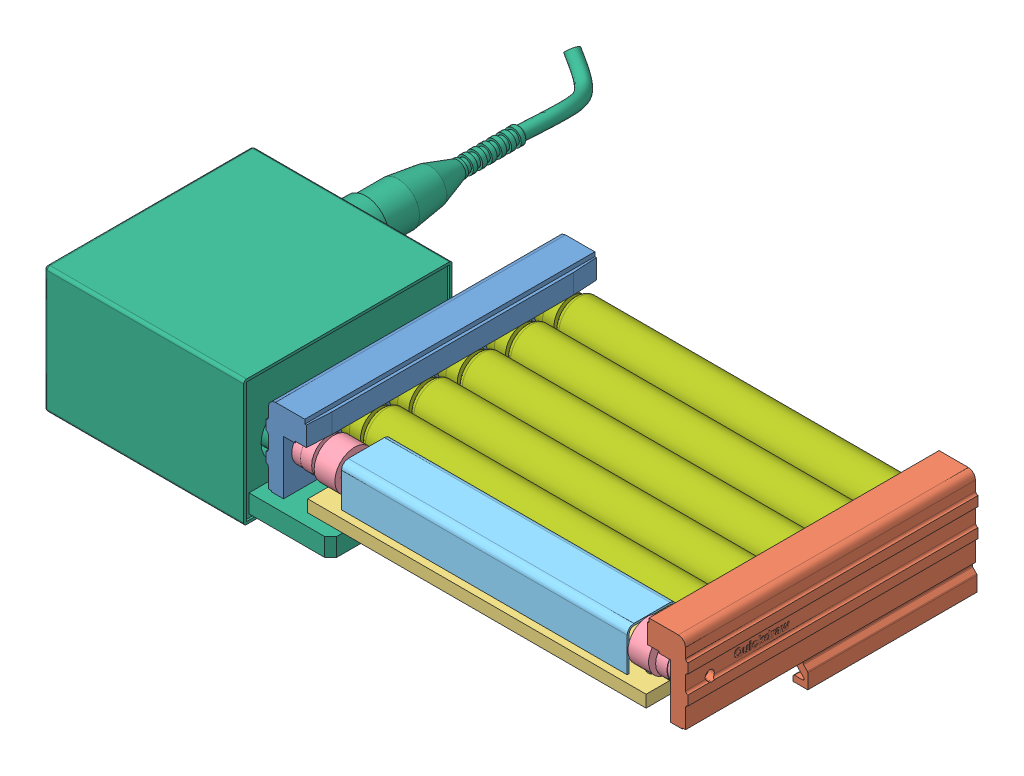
SolidWorks assembly Quickdraw-LR6TS-7-DDL-ESD.SLDASM, configuration Default (file format 12000). Lengths in mm.
Overall size (328.19 66.24 271.88).
12 component instances, 7 part files, 21 mates.
Components (placement in the parent):
- Quickdraw-LR6TS-7-DDL-ESD_LHRail-1: Quickdraw-LR6TS-7-DDL-ESD_LHRail.SLDPRT [TS] at (-21.463 -54.5084 0) size (22.1 54.51 152.4)
- Quickdraw-LR6TS-7-DDL-ESD_RHRail-1: Quickdraw-LR6TS-7-DDL-ESD_RHRail.SLDPRT [TS] at (199.263 -54.5084 0) x (-1 0 0) z (0 0 -1) size (22.1 54.51 152.4)
- Quickdraw-LR6TS-7-DDL-ESD_END PLATE-1: Quickdraw-LR6TS-7-DDL-ESD_END PLATE.SLDPRT [Default] at (0 -35.4584 0) size (177.8 6.35 101.6)
- Quickdraw-LR6TS-7-DDL-ESD_MR ROLLER ASSY LT-1: Quickdraw-LR6TS-7-DDL-ESD_MR ROLLER ASSY LT.SLDPRT [SD] at (-17.7038 -22.7076 -12.7) x (0 0 1) z (-1 0 0) size (20.75 20.75 31.27)
- Quickdraw-LR6TS-7-DDL-ESD_MR ROLLER ASSY LT-2: Quickdraw-LR6TS-7-DDL-ESD_MR ROLLER ASSY LT.SLDPRT [SD] at (195.5038 -22.7076 -12.7) x (0 0 -1) z (1 0 0) size (20.75 20.75 31.27)
- Quickdraw-LR6TS-7-DDL-ESD_collar_cover-1: Quickdraw-LR6TS-7-DDL-ESD_collar_cover.SLDPRT [Default] at (88.9 -34.4348 -54.6608) x (0 0 1) z (-1 0 0) size (50.8 21.59 150.11)
- Quickdraw-LR6TS-7-DDL-ESD_Motor PKG  DDL-1: Quickdraw-LR6TS-7-DDL-ESD_Motor PKG  DDL.SLDPRT [Default] at (-128.2954 -26.8349 -65.7893) size (146.69 66.24 271.88)
- Quickdraw-LR6TS-7-DDL-ESD_LongRoller-1: Quickdraw-LR6TS-7-DDL-ESD_LongRoller.SLDPRT [ESD] at (-17.7038 -22.7076 -139.7) x (0 -0.769947 -0.638108) z (1 0 0) size (21.97 21.97 213.21)
- Quickdraw-LR6TS-7-DDL-ESD_LongRoller-61: Quickdraw-LR6TS-7-DDL-ESD_LongRoller.SLDPRT [ESD] at (-17.7038 -22.7076 -114.3) x (0 -0.769947 -0.638108) z (1 0 0) size (21.97 21.97 213.21)
- Quickdraw-LR6TS-7-DDL-ESD_LongRoller-62: Quickdraw-LR6TS-7-DDL-ESD_LongRoller.SLDPRT [ESD] at (-17.7038 -22.7076 -88.9) x (0 -0.769947 -0.638108) z (1 0 0) size (21.97 21.97 213.21)
- Quickdraw-LR6TS-7-DDL-ESD_LongRoller-63: Quickdraw-LR6TS-7-DDL-ESD_LongRoller.SLDPRT [ESD] at (-17.7038 -22.7076 -63.5) x (0 -0.769947 -0.638108) z (1 0 0) size (21.97 21.97 213.21)
- Quickdraw-LR6TS-7-DDL-ESD_LongRoller-64: Quickdraw-LR6TS-7-DDL-ESD_LongRoller.SLDPRT [ESD] at (-17.7038 -22.7076 -38.1) x (0 -0.769947 -0.638108) z (1 0 0) size (21.97 21.97 213.21)
Mates (geometry in assembly coordinates):
- Coincident2: coincident: plane of LHRail-1 through (-16.9164 -3.81 0) normal (0 0 1)
- Coincident3: coincident: plane of LHRail-1 through (0 -54.5084 0) normal (1 0 0)
- Coincident4: coincident aligned: plane of LHRail-1 through (-1.5469 0 -152.4) normal (0 1 0)
- Coincident5: coincident aligned: plane of LHRail-1 through (-1.5469 0 -152.4) normal (0 1 0); plane of RHRail-1 through (179.3469 0 -152.4) normal (0 1 0)
- Coincident6: coincident aligned: plane of LHRail-1 through (-16.9164 -3.81 0) normal (0 0 1); plane of RHRail-1 through (194.7164 -3.81 0) normal (0 0 1)
- Coincident7: coincident: plane of RHRail-1 through (177.8 -54.5084 0) normal (-1 0 0)
- Coincident12: coincident anti-aligned: plane of LHRail-1 through (0 -54.5084 -152.4) normal (1 0 0); plane of Quickdraw-LR6TS-7-DDL-ESD_END PLATE-1 through (0 -41.8084 0) normal (-1 0 0)
- Coincident13: coincident aligned: plane of LHRail-1 through (-16.9164 -3.81 0) normal (0 0 1); plane of Quickdraw-LR6TS-7-DDL-ESD_END PLATE-1 through (279.5982 -35.4584 0) normal (0 0 1)
- Concentric1: concentric anti-aligned: cylinder of LHRail-1 through (-21.9965 -22.7076 -12.7) axis (1 0 0) radius 2.413; cylinder of Quickdraw-LR6TS-7-DDL-ESD_MR ROLLER ASSY LT-1 through (-12.7 -22.7076 -12.7) axis (-1 0 0) radius 2.413
- Coincident18: coincident anti-aligned: plane of LHRail-1 through (-12.7 -35.4584 -152.4) normal (1 0 0); plane of Quickdraw-LR6TS-7-DDL-ESD_MR ROLLER ASSY LT-1 through (-12.7 -22.7076 -12.7) normal (-1 0 0)
- Coincident19: coincident anti-aligned: plane of RHRail-1 through (190.5 -35.4584 -152.4) normal (-1 0 0); plane of Quickdraw-LR6TS-7-DDL-ESD_MR ROLLER ASSY LT-2 through (190.5 -22.7076 -12.7) normal (1 0 0)
- Concentric2: concentric anti-aligned: cylinder of RHRail-1 through (199.7965 -22.7076 -12.7) axis (-1 0 0) radius 2.413; cylinder of Quickdraw-LR6TS-7-DDL-ESD_MR ROLLER ASSY LT-2 through (190.5 -22.7076 -12.7) axis (1 0 0) radius 2.413
- Coincident23: coincident anti-aligned: plane of Quickdraw-LR6TS-7-DDL-ESD_END PLATE-1 through (279.5982 -35.4584 0) normal (0 1 0); plane of Quickdraw-LR6TS-7-DDL-ESD_collar_cover-1 through (13.843 -35.4584 -54.6608) normal (0 -1 0)
- Concentric3: concentric aligned: cylinder of Quickdraw-LR6TS-7-DDL-ESD_END PLATE-1 through (101.6 -41.8084 -50.8) axis (0 1 0) radius 1.7272; cylinder of Quickdraw-LR6TS-7-DDL-ESD_collar_cover-1 through (101.6 -34.4348 -50.8) axis (0 1 0) radius 2.286
- Concentric4: concentric aligned: cylinder of Quickdraw-LR6TS-7-DDL-ESD_END PLATE-1 through (76.2 -41.8084 -50.8) axis (0 1 0) radius 1.7272; cylinder of Quickdraw-LR6TS-7-DDL-ESD_collar_cover-1 through (76.2 -34.4348 -50.8) axis (0 1 0) radius 2.286
- Coincident28: coincident aligned: plane of LHRail-1 through (0 -35.4584 -152.4) normal (0 1 0); plane of Quickdraw-LR6TS-7-DDL-ESD_END PLATE-1 through (279.5982 -35.4584 0) normal (0 1 0)
- Coincident31: coincident anti-aligned: plane of LHRail-1 through (-12.7 -35.4584 -152.4) normal (1 0 0); plane of Quickdraw-LR6TS-7-DDL-ESD_LongRoller-1 through (-12.7 -24.6631 -137.3405) normal (-1 0 0)
- Concentric14: concentric anti-aligned: cylinder of LHRail-1 through (-21.9965 -22.7076 -139.7) axis (1 0 0) radius 2.413; cylinder of Quickdraw-LR6TS-7-DDL-ESD_LongRoller-1 through (-17.7038 -22.7076 -139.7) axis (-1 0 0) radius 2.413
- Coincident33: coincident anti-aligned: plane of Quickdraw-LR6TS-7-DDL-ESD_END PLATE-1 through (279.5982 -41.8084 0) normal (0 -1 0); plane of Quickdraw-LR6TS-7-DDL-ESD_Motor PKG  DDL-1 through (-24.5364 -41.8084 6.35) normal (0 1 0)
- Concentric17: concentric aligned: cylinder of Quickdraw-LR6TS-7-DDL-ESD_END PLATE-1 through (9.1948 -41.8084 -50.8) axis (0 1 0) radius 2.6162; cylinder of Quickdraw-LR6TS-7-DDL-ESD_Motor PKG  DDL-1 through (9.1948 -51.3334 -50.8) axis (0 1 0) radius 2.0193
- Concentric18: concentric aligned: circle of END PLATE-1; circle of Motor PKG  DDL-1
